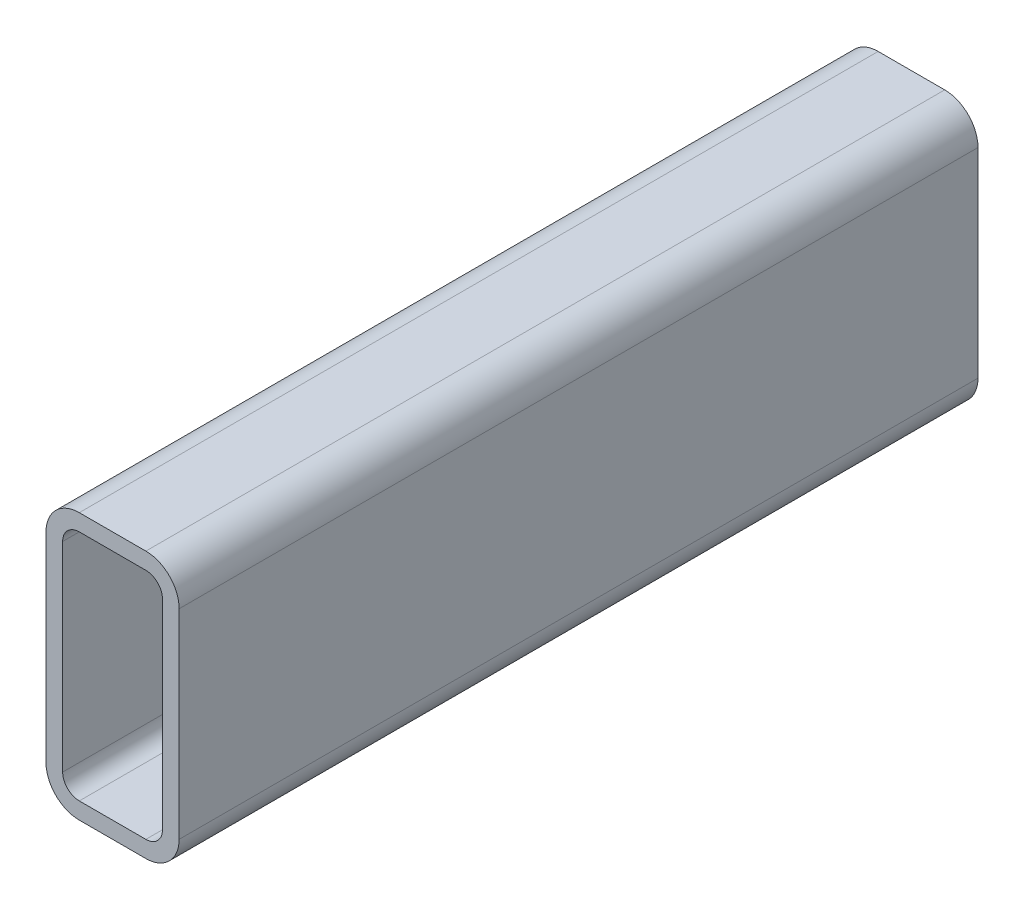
from build123d import *

# Parameters (mm, degrees)
BOSS_EXTRUDE1_DEPTH = 304.8


with BuildPart() as part:
    # Sketch1 → Boss-Extrude1 (new body)
    with BuildSketch(Plane.XY):
        with BuildLine():
            Line((12.7, 101.6), (38.1, 101.6))
            ThreePointArc((38.1, 101.6), (47.080256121, 97.880256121), (50.8, 88.9))
            Line((50.8, 88.9), (50.8, 12.7))
            ThreePointArc((50.8, 12.7), (47.080256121, 3.719743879), (38.1, 0))
            Line((38.1, 0), (12.7, 0))
            ThreePointArc((12.7, 0), (3.719743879, 3.719743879), (0, 12.7))
            Line((0, 12.7), (0, 88.9))
            ThreePointArc((0, 88.9), (3.719743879, 97.880256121), (12.7, 101.6))
        make_face()
        with BuildLine():
            Line((12.7, 95.25), (38.1, 95.25))
            ThreePointArc((38.1, 95.25), (42.590128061, 93.390128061), (44.45, 88.9))
            Line((44.45, 88.9), (44.45, 12.7))
            ThreePointArc((44.45, 12.7), (42.590128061, 8.209871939), (38.1, 6.35))
            Line((38.1, 6.35), (12.7, 6.35))
            ThreePointArc((12.7, 6.35), (8.209871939, 8.209871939), (6.35, 12.7))
            Line((6.35, 12.7), (6.35, 88.9))
            ThreePointArc((6.35, 88.9), (8.209871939, 93.390128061), (12.7, 95.25))
        make_face(mode=Mode.SUBTRACT)
    extrude(amount=BOSS_EXTRUDE1_DEPTH)


solid = part.part
